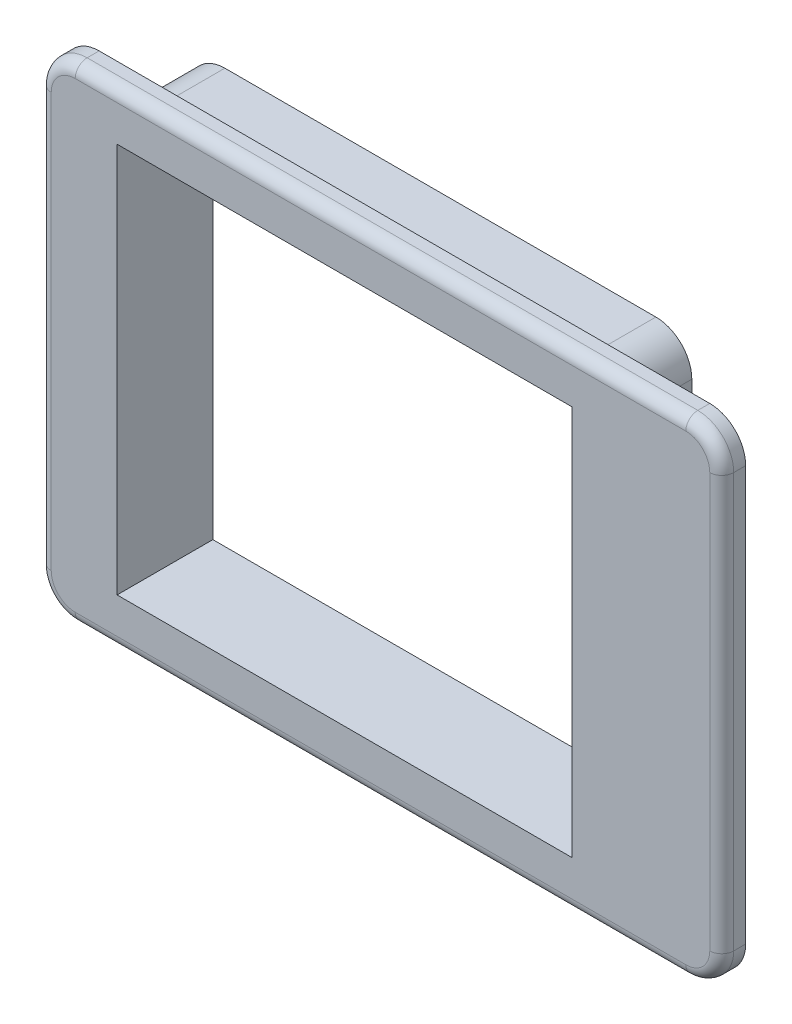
ISO-10303-21;
HEADER;
FILE_DESCRIPTION(('STEP AP214'),'2;1');
FILE_NAME('part.step','',(''),(''),'','','');
FILE_SCHEMA(('AUTOMOTIVE_DESIGN { 1 0 10303 214 1 1 1 1 }'));
ENDSEC;
DATA;
#1=APPLICATION_CONTEXT('core data for automotive mechanical design processes');
#2=APPLICATION_PROTOCOL_DEFINITION('international standard','automotive_design',2000,#1);
#3=PRODUCT_CONTEXT('',#1,'mechanical');
#4=PRODUCT('Part','Part','',(#3));
#5=PRODUCT_RELATED_PRODUCT_CATEGORY('part','',(#4));
#6=PRODUCT_DEFINITION_FORMATION('','',#4);
#7=PRODUCT_DEFINITION_CONTEXT('part definition',#1,'design');
#8=PRODUCT_DEFINITION('design','',#6,#7);
#9=PRODUCT_DEFINITION_SHAPE('','',#8);
#10=(LENGTH_UNIT() NAMED_UNIT(*) SI_UNIT(.MILLI.,.METRE.));
#11=(NAMED_UNIT(*) PLANE_ANGLE_UNIT() SI_UNIT($,.RADIAN.));
#12=(NAMED_UNIT(*) SI_UNIT($,.STERADIAN.) SOLID_ANGLE_UNIT());
#13=UNCERTAINTY_MEASURE_WITH_UNIT(LENGTH_MEASURE(1.E-05),#10,'distance_accuracy_value','');
#14=(GEOMETRIC_REPRESENTATION_CONTEXT(3) GLOBAL_UNCERTAINTY_ASSIGNED_CONTEXT((#13)) GLOBAL_UNIT_ASSIGNED_CONTEXT((#10,
#11,#12)) REPRESENTATION_CONTEXT('',''));
#15=CARTESIAN_POINT('',(0.,0.,0.));
#16=DIRECTION('',(0.,0.,1.));
#17=DIRECTION('',(1.,0.,0.));
#18=AXIS2_PLACEMENT_3D('',#15,#16,#17);
#19=CARTESIAN_POINT('',(1.00000000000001,1.,0.));
#20=DIRECTION('',(0.,0.,1.));
#21=DIRECTION('',(1.,0.,0.));
#22=AXIS2_PLACEMENT_3D('',#19,#20,#21);
#23=PLANE('',#22);
#24=CARTESIAN_POINT('',(1.00000000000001,1.,0.));
#25=DIRECTION('',(0.,0.,1.));
#26=DIRECTION('',(1.,0.,0.));
#27=AXIS2_PLACEMENT_3D('',#24,#25,#26);
#28=CIRCLE('',#27,3.);
#29=CARTESIAN_POINT('',(-2.,1.00000000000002,0.));
#30=VERTEX_POINT('',#29);
#31=CARTESIAN_POINT('',(1.00000000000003,-2.,0.));
#32=VERTEX_POINT('',#31);
#33=EDGE_CURVE('E202',#30,#32,#28,.T.);
#34=ORIENTED_EDGE('',*,*,#33,.F.);
#35=DIRECTION('',(0.,-1.,0.));
#36=VECTOR('',#35,1.);
#37=CARTESIAN_POINT('',(-2.,31.6,0.));
#38=LINE('',#37,#36);
#39=CARTESIAN_POINT('',(-2.,31.6,0.));
#40=VERTEX_POINT('',#39);
#41=EDGE_CURVE('E279',#40,#30,#38,.T.);
#42=ORIENTED_EDGE('',*,*,#41,.F.);
#43=CARTESIAN_POINT('',(1.,31.6,0.));
#44=DIRECTION('',(0.,0.,1.));
#45=DIRECTION('',(1.,0.,0.));
#46=AXIS2_PLACEMENT_3D('',#43,#44,#45);
#47=CIRCLE('',#46,3.);
#48=CARTESIAN_POINT('',(1.00000000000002,34.6,0.));
#49=VERTEX_POINT('',#48);
#50=EDGE_CURVE('E313',#49,#40,#47,.T.);
#51=ORIENTED_EDGE('',*,*,#50,.F.);
#52=DIRECTION('',(-1.,0.,0.));
#53=VECTOR('',#52,1.);
#54=CARTESIAN_POINT('',(1.00000000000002,34.6,0.));
#55=LINE('',#54,#53);
#56=CARTESIAN_POINT('',(37.,34.6,0.));
#57=VERTEX_POINT('',#56);
#58=EDGE_CURVE('E311',#57,#49,#55,.T.);
#59=ORIENTED_EDGE('',*,*,#58,.F.);
#60=CARTESIAN_POINT('',(37.,31.6,0.));
#61=DIRECTION('',(0.,0.,1.));
#62=DIRECTION('',(-1.,0.,0.));
#63=AXIS2_PLACEMENT_3D('',#60,#61,#62);
#64=CIRCLE('',#63,3.);
#65=CARTESIAN_POINT('',(40.,31.6,0.));
#66=VERTEX_POINT('',#65);
#67=EDGE_CURVE('E309',#66,#57,#64,.T.);
#68=ORIENTED_EDGE('',*,*,#67,.F.);
#69=DIRECTION('',(0.,1.,0.));
#70=VECTOR('',#69,1.);
#71=CARTESIAN_POINT('',(40.,31.6,0.));
#72=LINE('',#71,#70);
#73=CARTESIAN_POINT('',(40.,1.00000000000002,0.));
#74=VERTEX_POINT('',#73);
#75=EDGE_CURVE('E307',#74,#66,#72,.T.);
#76=ORIENTED_EDGE('',*,*,#75,.F.);
#77=CARTESIAN_POINT('',(37.,1.,0.));
#78=DIRECTION('',(0.,0.,1.));
#79=DIRECTION('',(1.,0.,0.));
#80=AXIS2_PLACEMENT_3D('',#77,#78,#79);
#81=CIRCLE('',#80,3.);
#82=CARTESIAN_POINT('',(37.,-2.,0.));
#83=VERTEX_POINT('',#82);
#84=EDGE_CURVE('E305',#83,#74,#81,.T.);
#85=ORIENTED_EDGE('',*,*,#84,.F.);
#86=DIRECTION('',(1.,0.,0.));
#87=VECTOR('',#86,1.);
#88=CARTESIAN_POINT('',(1.00000000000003,-2.,0.));
#89=LINE('',#88,#87);
#90=EDGE_CURVE('E303',#32,#83,#89,.T.);
#91=ORIENTED_EDGE('',*,*,#90,.F.);
#92=EDGE_LOOP('',(#34,#42,#51,#59,#68,#76,#85,#91));
#93=FACE_BOUND('',#92,.T.);
#94=DIRECTION('',(0.,-1.,0.));
#95=VECTOR('',#94,1.);
#96=CARTESIAN_POINT('',(0.,0.,0.));
#97=LINE('',#96,#95);
#98=CARTESIAN_POINT('',(0.,32.6,0.));
#99=VERTEX_POINT('',#98);
#100=CARTESIAN_POINT('',(0.,0.,0.));
#101=VERTEX_POINT('',#100);
#102=EDGE_CURVE('E262',#99,#101,#97,.T.);
#103=ORIENTED_EDGE('',*,*,#102,.T.);
#104=DIRECTION('',(1.,0.,0.));
#105=VECTOR('',#104,1.);
#106=CARTESIAN_POINT('',(0.,0.,0.));
#107=LINE('',#106,#105);
#108=CARTESIAN_POINT('',(38.,0.,0.));
#109=VERTEX_POINT('',#108);
#110=EDGE_CURVE('E199',#101,#109,#107,.T.);
#111=ORIENTED_EDGE('',*,*,#110,.T.);
#112=DIRECTION('',(0.,1.,0.));
#113=VECTOR('',#112,1.);
#114=CARTESIAN_POINT('',(38.,0.,0.));
#115=LINE('',#114,#113);
#116=CARTESIAN_POINT('',(38.,32.6,0.));
#117=VERTEX_POINT('',#116);
#118=EDGE_CURVE('E265',#109,#117,#115,.T.);
#119=ORIENTED_EDGE('',*,*,#118,.T.);
#120=DIRECTION('',(-1.,0.,0.));
#121=VECTOR('',#120,1.);
#122=CARTESIAN_POINT('',(0.,32.6,0.));
#123=LINE('',#122,#121);
#124=EDGE_CURVE('E268',#117,#99,#123,.T.);
#125=ORIENTED_EDGE('',*,*,#124,.T.);
#126=EDGE_LOOP('',(#103,#111,#119,#125));
#127=FACE_BOUND('',#126,.T.);
#128=ADVANCED_FACE('F31',(#93,#127),#23,.F.);
#129=CARTESIAN_POINT('',(1.00000000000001,1.,6.));
#130=DIRECTION('',(0.,0.,-1.));
#131=DIRECTION('',(-1.,0.,0.));
#132=AXIS2_PLACEMENT_3D('',#129,#130,#131);
#133=CYLINDRICAL_SURFACE('',#132,3.);
#134=ORIENTED_EDGE('',*,*,#33,.T.);
#135=DIRECTION('',(0.,0.,-1.));
#136=VECTOR('',#135,1.);
#137=CARTESIAN_POINT('',(1.00000000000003,-2.,6.));
#138=LINE('',#137,#136);
#139=CARTESIAN_POINT('',(1.00000000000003,-2.,6.));
#140=VERTEX_POINT('',#139);
#141=EDGE_CURVE('E336',#140,#32,#138,.T.);
#142=ORIENTED_EDGE('',*,*,#141,.F.);
#143=CARTESIAN_POINT('',(1.00000000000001,1.,6.));
#144=DIRECTION('',(0.,0.,1.));
#145=DIRECTION('',(1.,0.,0.));
#146=AXIS2_PLACEMENT_3D('',#143,#144,#145);
#147=CIRCLE('',#146,3.);
#148=CARTESIAN_POINT('',(-2.,1.00000000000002,6.));
#149=VERTEX_POINT('',#148);
#150=EDGE_CURVE('E275',#149,#140,#147,.T.);
#151=ORIENTED_EDGE('',*,*,#150,.F.);
#152=DIRECTION('',(0.,0.,-1.));
#153=VECTOR('',#152,1.);
#154=CARTESIAN_POINT('',(-2.,1.00000000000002,6.));
#155=LINE('',#154,#153);
#156=EDGE_CURVE('E300',#149,#30,#155,.T.);
#157=ORIENTED_EDGE('',*,*,#156,.T.);
#158=EDGE_LOOP('',(#134,#142,#151,#157));
#159=FACE_BOUND('',#158,.T.);
#160=ADVANCED_FACE('F458',(#159),#133,.T.);
#161=CARTESIAN_POINT('',(1.00000000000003,-2.,6.));
#162=DIRECTION('',(0.,1.,0.));
#163=DIRECTION('',(0.,0.,1.));
#164=AXIS2_PLACEMENT_3D('',#161,#162,#163);
#165=PLANE('',#164);
#166=ORIENTED_EDGE('',*,*,#90,.T.);
#167=DIRECTION('',(0.,0.,-1.));
#168=VECTOR('',#167,1.);
#169=CARTESIAN_POINT('',(37.,-2.,6.));
#170=LINE('',#169,#168);
#171=CARTESIAN_POINT('',(37.,-2.,6.));
#172=VERTEX_POINT('',#171);
#173=EDGE_CURVE('E333',#172,#83,#170,.T.);
#174=ORIENTED_EDGE('',*,*,#173,.F.);
#175=DIRECTION('',(1.,0.,0.));
#176=VECTOR('',#175,1.);
#177=CARTESIAN_POINT('',(1.00000000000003,-2.,6.));
#178=LINE('',#177,#176);
#179=EDGE_CURVE('E278',#140,#172,#178,.T.);
#180=ORIENTED_EDGE('',*,*,#179,.F.);
#181=ORIENTED_EDGE('',*,*,#141,.T.);
#182=EDGE_LOOP('',(#166,#174,#180,#181));
#183=FACE_BOUND('',#182,.T.);
#184=ADVANCED_FACE('F464',(#183),#165,.F.);
#185=CARTESIAN_POINT('',(37.,1.,6.));
#186=DIRECTION('',(0.,0.,-1.));
#187=DIRECTION('',(-1.,0.,0.));
#188=AXIS2_PLACEMENT_3D('',#185,#186,#187);
#189=CYLINDRICAL_SURFACE('',#188,3.);
#190=ORIENTED_EDGE('',*,*,#84,.T.);
#191=DIRECTION('',(0.,0.,-1.));
#192=VECTOR('',#191,1.);
#193=CARTESIAN_POINT('',(40.,1.00000000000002,6.));
#194=LINE('',#193,#192);
#195=CARTESIAN_POINT('',(40.,1.00000000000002,6.));
#196=VERTEX_POINT('',#195);
#197=EDGE_CURVE('E330',#196,#74,#194,.T.);
#198=ORIENTED_EDGE('',*,*,#197,.F.);
#199=CARTESIAN_POINT('',(37.,1.,6.));
#200=DIRECTION('',(0.,0.,1.));
#201=DIRECTION('',(1.,0.,0.));
#202=AXIS2_PLACEMENT_3D('',#199,#200,#201);
#203=CIRCLE('',#202,3.);
#204=EDGE_CURVE('E282',#172,#196,#203,.T.);
#205=ORIENTED_EDGE('',*,*,#204,.F.);
#206=ORIENTED_EDGE('',*,*,#173,.T.);
#207=EDGE_LOOP('',(#190,#198,#205,#206));
#208=FACE_BOUND('',#207,.T.);
#209=ADVANCED_FACE('F491',(#208),#189,.T.);
#210=CARTESIAN_POINT('',(40.,31.6,6.));
#211=DIRECTION('',(-1.,0.,0.));
#212=DIRECTION('',(0.,-1.,0.));
#213=AXIS2_PLACEMENT_3D('',#210,#211,#212);
#214=PLANE('',#213);
#215=ORIENTED_EDGE('',*,*,#75,.T.);
#216=DIRECTION('',(0.,0.,-1.));
#217=VECTOR('',#216,1.);
#218=CARTESIAN_POINT('',(40.,31.6,6.));
#219=LINE('',#218,#217);
#220=CARTESIAN_POINT('',(40.,31.6,6.));
#221=VERTEX_POINT('',#220);
#222=EDGE_CURVE('E327',#221,#66,#219,.T.);
#223=ORIENTED_EDGE('',*,*,#222,.F.);
#224=DIRECTION('',(0.,1.,0.));
#225=VECTOR('',#224,1.);
#226=CARTESIAN_POINT('',(40.,31.6,6.));
#227=LINE('',#226,#225);
#228=EDGE_CURVE('E285',#196,#221,#227,.T.);
#229=ORIENTED_EDGE('',*,*,#228,.F.);
#230=ORIENTED_EDGE('',*,*,#197,.T.);
#231=EDGE_LOOP('',(#215,#223,#229,#230));
#232=FACE_BOUND('',#231,.T.);
#233=ADVANCED_FACE('F487',(#232),#214,.F.);
#234=CARTESIAN_POINT('',(37.,31.6,6.));
#235=DIRECTION('',(0.,0.,-1.));
#236=DIRECTION('',(-1.,0.,0.));
#237=AXIS2_PLACEMENT_3D('',#234,#235,#236);
#238=CYLINDRICAL_SURFACE('',#237,3.);
#239=ORIENTED_EDGE('',*,*,#67,.T.);
#240=DIRECTION('',(0.,0.,-1.));
#241=VECTOR('',#240,1.);
#242=CARTESIAN_POINT('',(37.,34.6,6.));
#243=LINE('',#242,#241);
#244=CARTESIAN_POINT('',(37.,34.6,6.));
#245=VERTEX_POINT('',#244);
#246=EDGE_CURVE('E324',#245,#57,#243,.T.);
#247=ORIENTED_EDGE('',*,*,#246,.F.);
#248=CARTESIAN_POINT('',(37.,31.6,6.));
#249=DIRECTION('',(0.,0.,1.));
#250=DIRECTION('',(-1.,0.,0.));
#251=AXIS2_PLACEMENT_3D('',#248,#249,#250);
#252=CIRCLE('',#251,3.);
#253=EDGE_CURVE('E288',#221,#245,#252,.T.);
#254=ORIENTED_EDGE('',*,*,#253,.F.);
#255=ORIENTED_EDGE('',*,*,#222,.T.);
#256=EDGE_LOOP('',(#239,#247,#254,#255));
#257=FACE_BOUND('',#256,.T.);
#258=ADVANCED_FACE('F483',(#257),#238,.T.);
#259=CARTESIAN_POINT('',(1.00000000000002,34.6,6.));
#260=DIRECTION('',(0.,-1.,0.));
#261=DIRECTION('',(0.,0.,-1.));
#262=AXIS2_PLACEMENT_3D('',#259,#260,#261);
#263=PLANE('',#262);
#264=ORIENTED_EDGE('',*,*,#58,.T.);
#265=DIRECTION('',(0.,0.,-1.));
#266=VECTOR('',#265,1.);
#267=CARTESIAN_POINT('',(1.00000000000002,34.6,6.));
#268=LINE('',#267,#266);
#269=CARTESIAN_POINT('',(1.00000000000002,34.6,6.));
#270=VERTEX_POINT('',#269);
#271=EDGE_CURVE('E321',#270,#49,#268,.T.);
#272=ORIENTED_EDGE('',*,*,#271,.F.);
#273=DIRECTION('',(-1.,0.,0.));
#274=VECTOR('',#273,1.);
#275=CARTESIAN_POINT('',(1.00000000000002,34.6,6.));
#276=LINE('',#275,#274);
#277=EDGE_CURVE('E291',#245,#270,#276,.T.);
#278=ORIENTED_EDGE('',*,*,#277,.F.);
#279=ORIENTED_EDGE('',*,*,#246,.T.);
#280=EDGE_LOOP('',(#264,#272,#278,#279));
#281=FACE_BOUND('',#280,.T.);
#282=ADVANCED_FACE('F479',(#281),#263,.F.);
#283=CARTESIAN_POINT('',(1.,31.6,6.));
#284=DIRECTION('',(0.,0.,-1.));
#285=DIRECTION('',(-1.,0.,0.));
#286=AXIS2_PLACEMENT_3D('',#283,#284,#285);
#287=CYLINDRICAL_SURFACE('',#286,3.);
#288=ORIENTED_EDGE('',*,*,#50,.T.);
#289=DIRECTION('',(0.,0.,-1.));
#290=VECTOR('',#289,1.);
#291=CARTESIAN_POINT('',(-2.,31.6,6.));
#292=LINE('',#291,#290);
#293=CARTESIAN_POINT('',(-2.,31.6,6.));
#294=VERTEX_POINT('',#293);
#295=EDGE_CURVE('E318',#294,#40,#292,.T.);
#296=ORIENTED_EDGE('',*,*,#295,.F.);
#297=CARTESIAN_POINT('',(1.,31.6,6.));
#298=DIRECTION('',(0.,0.,1.));
#299=DIRECTION('',(1.,0.,0.));
#300=AXIS2_PLACEMENT_3D('',#297,#298,#299);
#301=CIRCLE('',#300,3.);
#302=EDGE_CURVE('E294',#270,#294,#301,.T.);
#303=ORIENTED_EDGE('',*,*,#302,.F.);
#304=ORIENTED_EDGE('',*,*,#271,.T.);
#305=EDGE_LOOP('',(#288,#296,#303,#304));
#306=FACE_BOUND('',#305,.T.);
#307=ADVANCED_FACE('F475',(#306),#287,.T.);
#308=CARTESIAN_POINT('',(-2.,31.6,6.));
#309=DIRECTION('',(1.,0.,0.));
#310=DIRECTION('',(0.,1.,0.));
#311=AXIS2_PLACEMENT_3D('',#308,#309,#310);
#312=PLANE('',#311);
#313=ORIENTED_EDGE('',*,*,#41,.T.);
#314=ORIENTED_EDGE('',*,*,#156,.F.);
#315=DIRECTION('',(0.,-1.,0.));
#316=VECTOR('',#315,1.);
#317=CARTESIAN_POINT('',(-2.,31.6,6.));
#318=LINE('',#317,#316);
#319=EDGE_CURVE('E297',#294,#149,#318,.T.);
#320=ORIENTED_EDGE('',*,*,#319,.F.);
#321=ORIENTED_EDGE('',*,*,#295,.T.);
#322=EDGE_LOOP('',(#313,#314,#320,#321));
#323=FACE_BOUND('',#322,.T.);
#324=ADVANCED_FACE('F472',(#323),#312,.F.);
#325=CARTESIAN_POINT('',(0.,0.,6.));
#326=DIRECTION('',(1.,0.,0.));
#327=DIRECTION('',(0.,0.,-1.));
#328=AXIS2_PLACEMENT_3D('',#325,#326,#327);
#329=PLANE('',#328);
#330=ORIENTED_EDGE('',*,*,#102,.F.);
#331=DIRECTION('',(0.,0.,-1.));
#332=VECTOR('',#331,1.);
#333=CARTESIAN_POINT('',(0.,32.6,6.));
#334=LINE('',#333,#332);
#335=CARTESIAN_POINT('',(0.,32.6,8.));
#336=VERTEX_POINT('',#335);
#337=EDGE_CURVE('E209',#336,#99,#334,.T.);
#338=ORIENTED_EDGE('',*,*,#337,.F.);
#339=DIRECTION('',(0.,-1.,0.));
#340=VECTOR('',#339,1.);
#341=CARTESIAN_POINT('',(0.,32.6,8.));
#342=LINE('',#341,#340);
#343=CARTESIAN_POINT('',(0.,0.,8.));
#344=VERTEX_POINT('',#343);
#345=EDGE_CURVE('E206',#336,#344,#342,.T.);
#346=ORIENTED_EDGE('',*,*,#345,.T.);
#347=DIRECTION('',(0.,0.,-1.));
#348=VECTOR('',#347,1.);
#349=CARTESIAN_POINT('',(0.,0.,6.));
#350=LINE('',#349,#348);
#351=EDGE_CURVE('E192',#344,#101,#350,.T.);
#352=ORIENTED_EDGE('',*,*,#351,.T.);
#353=EDGE_LOOP('',(#330,#338,#346,#352));
#354=FACE_BOUND('',#353,.T.);
#355=ADVANCED_FACE('F207',(#354),#329,.T.);
#356=CARTESIAN_POINT('',(0.,0.,6.));
#357=DIRECTION('',(0.,1.,0.));
#358=DIRECTION('',(0.,0.,1.));
#359=AXIS2_PLACEMENT_3D('',#356,#357,#358);
#360=PLANE('',#359);
#361=ORIENTED_EDGE('',*,*,#110,.F.);
#362=ORIENTED_EDGE('',*,*,#351,.F.);
#363=DIRECTION('',(1.,0.,0.));
#364=VECTOR('',#363,1.);
#365=CARTESIAN_POINT('',(0.,0.,8.));
#366=LINE('',#365,#364);
#367=CARTESIAN_POINT('',(38.,0.,8.));
#368=VERTEX_POINT('',#367);
#369=EDGE_CURVE('E196',#344,#368,#366,.T.);
#370=ORIENTED_EDGE('',*,*,#369,.T.);
#371=DIRECTION('',(0.,0.,-1.));
#372=VECTOR('',#371,1.);
#373=CARTESIAN_POINT('',(38.,0.,6.));
#374=LINE('',#373,#372);
#375=EDGE_CURVE('E203',#368,#109,#374,.T.);
#376=ORIENTED_EDGE('',*,*,#375,.T.);
#377=EDGE_LOOP('',(#361,#362,#370,#376));
#378=FACE_BOUND('',#377,.T.);
#379=ADVANCED_FACE('F194',(#378),#360,.T.);
#380=CARTESIAN_POINT('',(38.,0.,6.));
#381=DIRECTION('',(-1.,0.,0.));
#382=DIRECTION('',(0.,0.,1.));
#383=AXIS2_PLACEMENT_3D('',#380,#381,#382);
#384=PLANE('',#383);
#385=ORIENTED_EDGE('',*,*,#118,.F.);
#386=ORIENTED_EDGE('',*,*,#375,.F.);
#387=DIRECTION('',(0.,1.,0.));
#388=VECTOR('',#387,1.);
#389=CARTESIAN_POINT('',(38.,32.6,8.));
#390=LINE('',#389,#388);
#391=CARTESIAN_POINT('',(38.,32.6,8.));
#392=VERTEX_POINT('',#391);
#393=EDGE_CURVE('E216',#368,#392,#390,.T.);
#394=ORIENTED_EDGE('',*,*,#393,.T.);
#395=DIRECTION('',(0.,0.,-1.));
#396=VECTOR('',#395,1.);
#397=CARTESIAN_POINT('',(38.,32.6,6.));
#398=LINE('',#397,#396);
#399=EDGE_CURVE('E272',#392,#117,#398,.T.);
#400=ORIENTED_EDGE('',*,*,#399,.T.);
#401=EDGE_LOOP('',(#385,#386,#394,#400));
#402=FACE_BOUND('',#401,.T.);
#403=ADVANCED_FACE('F631',(#402),#384,.T.);
#404=CARTESIAN_POINT('',(0.,32.6,6.));
#405=DIRECTION('',(0.,-1.,0.));
#406=DIRECTION('',(0.,0.,-1.));
#407=AXIS2_PLACEMENT_3D('',#404,#405,#406);
#408=PLANE('',#407);
#409=ORIENTED_EDGE('',*,*,#124,.F.);
#410=ORIENTED_EDGE('',*,*,#399,.F.);
#411=DIRECTION('',(-1.,0.,0.));
#412=VECTOR('',#411,1.);
#413=CARTESIAN_POINT('',(0.,32.6,8.));
#414=LINE('',#413,#412);
#415=EDGE_CURVE('E218',#392,#336,#414,.T.);
#416=ORIENTED_EDGE('',*,*,#415,.T.);
#417=ORIENTED_EDGE('',*,*,#337,.T.);
#418=EDGE_LOOP('',(#409,#410,#416,#417));
#419=FACE_BOUND('',#418,.T.);
#420=ADVANCED_FACE('F622',(#419),#408,.T.);
#421=CARTESIAN_POINT('',(-3.49999999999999,-1.,6.));
#422=DIRECTION('',(0.,0.,1.));
#423=DIRECTION('',(1.,0.,0.));
#424=AXIS2_PLACEMENT_3D('',#421,#422,#423);
#425=PLANE('',#424);
#426=CARTESIAN_POINT('',(-3.49999999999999,-1.,6.));
#427=DIRECTION('',(0.,0.,1.));
#428=DIRECTION('',(1.,0.,0.));
#429=AXIS2_PLACEMENT_3D('',#426,#427,#428);
#430=CIRCLE('',#429,3.);
#431=CARTESIAN_POINT('',(-6.49999999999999,-1.,6.));
#432=VERTEX_POINT('',#431);
#433=CARTESIAN_POINT('',(-3.49999999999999,-4.,6.));
#434=VERTEX_POINT('',#433);
#435=EDGE_CURVE('E222',#432,#434,#430,.T.);
#436=ORIENTED_EDGE('',*,*,#435,.F.);
#437=DIRECTION('',(0.,-1.,0.));
#438=VECTOR('',#437,1.);
#439=CARTESIAN_POINT('',(-6.5,33.6,6.));
#440=LINE('',#439,#438);
#441=CARTESIAN_POINT('',(-6.5,33.6,6.));
#442=VERTEX_POINT('',#441);
#443=EDGE_CURVE('E243',#442,#432,#440,.T.);
#444=ORIENTED_EDGE('',*,*,#443,.F.);
#445=CARTESIAN_POINT('',(-3.5,33.6,6.));
#446=DIRECTION('',(0.,0.,1.));
#447=DIRECTION('',(1.,0.,0.));
#448=AXIS2_PLACEMENT_3D('',#445,#446,#447);
#449=CIRCLE('',#448,3.);
#450=CARTESIAN_POINT('',(-3.5,36.6,6.));
#451=VERTEX_POINT('',#450);
#452=EDGE_CURVE('E240',#451,#442,#449,.T.);
#453=ORIENTED_EDGE('',*,*,#452,.F.);
#454=DIRECTION('',(-1.,0.,0.));
#455=VECTOR('',#454,1.);
#456=CARTESIAN_POINT('',(-3.5,36.6,6.));
#457=LINE('',#456,#455);
#458=CARTESIAN_POINT('',(47.5,36.6,6.));
#459=VERTEX_POINT('',#458);
#460=EDGE_CURVE('E237',#459,#451,#457,.T.);
#461=ORIENTED_EDGE('',*,*,#460,.F.);
#462=CARTESIAN_POINT('',(47.5,33.6,6.));
#463=DIRECTION('',(0.,0.,1.));
#464=DIRECTION('',(-1.,0.,0.));
#465=AXIS2_PLACEMENT_3D('',#462,#463,#464);
#466=CIRCLE('',#465,3.);
#467=CARTESIAN_POINT('',(50.5,33.6,6.));
#468=VERTEX_POINT('',#467);
#469=EDGE_CURVE('E234',#468,#459,#466,.T.);
#470=ORIENTED_EDGE('',*,*,#469,.F.);
#471=DIRECTION('',(0.,1.,0.));
#472=VECTOR('',#471,1.);
#473=CARTESIAN_POINT('',(50.5,33.6,6.));
#474=LINE('',#473,#472);
#475=CARTESIAN_POINT('',(50.5,-1.,6.));
#476=VERTEX_POINT('',#475);
#477=EDGE_CURVE('E231',#476,#468,#474,.T.);
#478=ORIENTED_EDGE('',*,*,#477,.F.);
#479=CARTESIAN_POINT('',(47.5,-1.,6.));
#480=DIRECTION('',(0.,0.,1.));
#481=DIRECTION('',(1.,0.,0.));
#482=AXIS2_PLACEMENT_3D('',#479,#480,#481);
#483=CIRCLE('',#482,3.);
#484=CARTESIAN_POINT('',(47.5,-4.,6.));
#485=VERTEX_POINT('',#484);
#486=EDGE_CURVE('E228',#485,#476,#483,.T.);
#487=ORIENTED_EDGE('',*,*,#486,.F.);
#488=DIRECTION('',(1.,0.,0.));
#489=VECTOR('',#488,1.);
#490=CARTESIAN_POINT('',(-3.49999999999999,-4.,6.));
#491=LINE('',#490,#489);
#492=EDGE_CURVE('E225',#434,#485,#491,.T.);
#493=ORIENTED_EDGE('',*,*,#492,.F.);
#494=EDGE_LOOP('',(#436,#444,#453,#461,#470,#478,#487,#493));
#495=FACE_BOUND('',#494,.T.);
#496=ORIENTED_EDGE('',*,*,#319,.T.);
#497=ORIENTED_EDGE('',*,*,#150,.T.);
#498=ORIENTED_EDGE('',*,*,#179,.T.);
#499=ORIENTED_EDGE('',*,*,#204,.T.);
#500=ORIENTED_EDGE('',*,*,#228,.T.);
#501=ORIENTED_EDGE('',*,*,#253,.T.);
#502=ORIENTED_EDGE('',*,*,#277,.T.);
#503=ORIENTED_EDGE('',*,*,#302,.T.);
#504=EDGE_LOOP('',(#496,#497,#498,#499,#500,#501,#502,#503));
#505=FACE_BOUND('',#504,.T.);
#506=ADVANCED_FACE('F413',(#495,#505),#425,.F.);
#507=CARTESIAN_POINT('',(-3.49999999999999,-1.,8.));
#508=DIRECTION('',(0.,0.,1.));
#509=DIRECTION('',(1.,0.,0.));
#510=AXIS2_PLACEMENT_3D('',#507,#508,#509);
#511=PLANE('',#510);
#512=DIRECTION('',(-1.,0.,0.));
#513=VECTOR('',#512,1.);
#514=CARTESIAN_POINT('',(-3.5,35.6,8.));
#515=LINE('',#514,#513);
#516=CARTESIAN_POINT('',(47.5,35.6,8.));
#517=VERTEX_POINT('',#516);
#518=CARTESIAN_POINT('',(-3.5,35.6,8.));
#519=VERTEX_POINT('',#518);
#520=EDGE_CURVE('E339',#517,#519,#515,.T.);
#521=ORIENTED_EDGE('',*,*,#520,.T.);
#522=CARTESIAN_POINT('',(-3.5,33.6,8.));
#523=DIRECTION('',(0.,0.,1.));
#524=DIRECTION('',(1.,0.,0.));
#525=AXIS2_PLACEMENT_3D('',#522,#523,#524);
#526=CIRCLE('',#525,2.);
#527=CARTESIAN_POINT('',(-5.5,33.6,8.));
#528=VERTEX_POINT('',#527);
#529=EDGE_CURVE('E353',#519,#528,#526,.T.);
#530=ORIENTED_EDGE('',*,*,#529,.T.);
#531=DIRECTION('',(0.,-1.,0.));
#532=VECTOR('',#531,1.);
#533=CARTESIAN_POINT('',(-5.49999999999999,-1.,8.));
#534=LINE('',#533,#532);
#535=CARTESIAN_POINT('',(-5.49999999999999,-1.,8.));
#536=VERTEX_POINT('',#535);
#537=EDGE_CURVE('E351',#528,#536,#534,.T.);
#538=ORIENTED_EDGE('',*,*,#537,.T.);
#539=CARTESIAN_POINT('',(-3.49999999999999,-1.,8.));
#540=DIRECTION('',(0.,0.,1.));
#541=DIRECTION('',(1.,0.,0.));
#542=AXIS2_PLACEMENT_3D('',#539,#540,#541);
#543=CIRCLE('',#542,2.);
#544=CARTESIAN_POINT('',(-3.49999999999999,-3.,8.));
#545=VERTEX_POINT('',#544);
#546=EDGE_CURVE('E349',#536,#545,#543,.T.);
#547=ORIENTED_EDGE('',*,*,#546,.T.);
#548=DIRECTION('',(1.,0.,0.));
#549=VECTOR('',#548,1.);
#550=CARTESIAN_POINT('',(47.5,-3.,8.));
#551=LINE('',#550,#549);
#552=CARTESIAN_POINT('',(47.5,-3.,8.));
#553=VERTEX_POINT('',#552);
#554=EDGE_CURVE('E347',#545,#553,#551,.T.);
#555=ORIENTED_EDGE('',*,*,#554,.T.);
#556=CARTESIAN_POINT('',(47.5,-1.,8.));
#557=DIRECTION('',(0.,0.,1.));
#558=DIRECTION('',(1.,0.,0.));
#559=AXIS2_PLACEMENT_3D('',#556,#557,#558);
#560=CIRCLE('',#559,2.);
#561=CARTESIAN_POINT('',(49.5,-1.,8.));
#562=VERTEX_POINT('',#561);
#563=EDGE_CURVE('E345',#553,#562,#560,.T.);
#564=ORIENTED_EDGE('',*,*,#563,.T.);
#565=DIRECTION('',(0.,1.,0.));
#566=VECTOR('',#565,1.);
#567=CARTESIAN_POINT('',(49.5,33.6,8.));
#568=LINE('',#567,#566);
#569=CARTESIAN_POINT('',(49.5,33.6,8.));
#570=VERTEX_POINT('',#569);
#571=EDGE_CURVE('E343',#562,#570,#568,.T.);
#572=ORIENTED_EDGE('',*,*,#571,.T.);
#573=CARTESIAN_POINT('',(47.5,33.6,8.));
#574=DIRECTION('',(0.,0.,1.));
#575=DIRECTION('',(1.,0.,0.));
#576=AXIS2_PLACEMENT_3D('',#573,#574,#575);
#577=CIRCLE('',#576,2.);
#578=EDGE_CURVE('E341',#570,#517,#577,.T.);
#579=ORIENTED_EDGE('',*,*,#578,.T.);
#580=EDGE_LOOP('',(#521,#530,#538,#547,#555,#564,#572,#579));
#581=FACE_BOUND('',#580,.T.);
#582=ORIENTED_EDGE('',*,*,#369,.F.);
#583=ORIENTED_EDGE('',*,*,#345,.F.);
#584=ORIENTED_EDGE('',*,*,#415,.F.);
#585=ORIENTED_EDGE('',*,*,#393,.F.);
#586=EDGE_LOOP('',(#582,#583,#584,#585));
#587=FACE_BOUND('',#586,.T.);
#588=ADVANCED_FACE('F214',(#581,#587),#511,.T.);
#589=CARTESIAN_POINT('',(-3.49999999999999,-1.,8.));
#590=DIRECTION('',(0.,0.,-1.));
#591=DIRECTION('',(-1.,0.,0.));
#592=AXIS2_PLACEMENT_3D('',#589,#590,#591);
#593=CYLINDRICAL_SURFACE('',#592,3.);
#594=DIRECTION('',(0.,0.,-1.));
#595=VECTOR('',#594,1.);
#596=CARTESIAN_POINT('',(-3.49999999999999,-4.,8.));
#597=LINE('',#596,#595);
#598=CARTESIAN_POINT('',(-3.49999999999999,-4.,7.));
#599=VERTEX_POINT('',#598);
#600=EDGE_CURVE('E260',#599,#434,#597,.T.);
#601=ORIENTED_EDGE('',*,*,#600,.F.);
#602=CARTESIAN_POINT('',(-3.49999999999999,-1.,7.));
#603=DIRECTION('',(0.,0.,1.));
#604=DIRECTION('',(1.,0.,0.));
#605=AXIS2_PLACEMENT_3D('',#602,#603,#604);
#606=CIRCLE('',#605,3.);
#607=CARTESIAN_POINT('',(-6.49999999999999,-1.,7.));
#608=VERTEX_POINT('',#607);
#609=EDGE_CURVE('E361',#599,#608,#606,.F.);
#610=ORIENTED_EDGE('',*,*,#609,.T.);
#611=DIRECTION('',(0.,0.,-1.));
#612=VECTOR('',#611,1.);
#613=CARTESIAN_POINT('',(-6.49999999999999,-1.,8.));
#614=LINE('',#613,#612);
#615=EDGE_CURVE('E246',#608,#432,#614,.T.);
#616=ORIENTED_EDGE('',*,*,#615,.T.);
#617=ORIENTED_EDGE('',*,*,#435,.T.);
#618=EDGE_LOOP('',(#601,#610,#616,#617));
#619=FACE_BOUND('',#618,.T.);
#620=ADVANCED_FACE('F599',(#619),#593,.T.);
#621=CARTESIAN_POINT('',(-3.49999999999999,-4.,8.));
#622=DIRECTION('',(0.,1.,0.));
#623=DIRECTION('',(-1.,0.,0.));
#624=AXIS2_PLACEMENT_3D('',#621,#622,#623);
#625=PLANE('',#624);
#626=DIRECTION('',(0.,0.,-1.));
#627=VECTOR('',#626,1.);
#628=CARTESIAN_POINT('',(47.5,-4.,8.));
#629=LINE('',#628,#627);
#630=CARTESIAN_POINT('',(47.5,-4.,7.));
#631=VERTEX_POINT('',#630);
#632=EDGE_CURVE('E258',#631,#485,#629,.T.);
#633=ORIENTED_EDGE('',*,*,#632,.F.);
#634=DIRECTION('',(1.,0.,0.));
#635=VECTOR('',#634,1.);
#636=CARTESIAN_POINT('',(-3.49999999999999,-4.,7.));
#637=LINE('',#636,#635);
#638=EDGE_CURVE('E363',#631,#599,#637,.F.);
#639=ORIENTED_EDGE('',*,*,#638,.T.);
#640=ORIENTED_EDGE('',*,*,#600,.T.);
#641=ORIENTED_EDGE('',*,*,#492,.T.);
#642=EDGE_LOOP('',(#633,#639,#640,#641));
#643=FACE_BOUND('',#642,.T.);
#644=ADVANCED_FACE('F406',(#643),#625,.F.);
#645=CARTESIAN_POINT('',(47.5,-1.,8.));
#646=DIRECTION('',(0.,0.,-1.));
#647=DIRECTION('',(-1.,0.,0.));
#648=AXIS2_PLACEMENT_3D('',#645,#646,#647);
#649=CYLINDRICAL_SURFACE('',#648,3.);
#650=DIRECTION('',(0.,0.,-1.));
#651=VECTOR('',#650,1.);
#652=CARTESIAN_POINT('',(50.5,-1.,8.));
#653=LINE('',#652,#651);
#654=CARTESIAN_POINT('',(50.5,-1.,7.));
#655=VERTEX_POINT('',#654);
#656=EDGE_CURVE('E256',#655,#476,#653,.T.);
#657=ORIENTED_EDGE('',*,*,#656,.F.);
#658=CARTESIAN_POINT('',(47.5,-1.,7.));
#659=DIRECTION('',(0.,0.,1.));
#660=DIRECTION('',(1.,0.,0.));
#661=AXIS2_PLACEMENT_3D('',#658,#659,#660);
#662=CIRCLE('',#661,3.);
#663=EDGE_CURVE('E365',#655,#631,#662,.F.);
#664=ORIENTED_EDGE('',*,*,#663,.T.);
#665=ORIENTED_EDGE('',*,*,#632,.T.);
#666=ORIENTED_EDGE('',*,*,#486,.T.);
#667=EDGE_LOOP('',(#657,#664,#665,#666));
#668=FACE_BOUND('',#667,.T.);
#669=ADVANCED_FACE('F404',(#668),#649,.T.);
#670=CARTESIAN_POINT('',(50.5,33.6,8.));
#671=DIRECTION('',(-1.,0.,0.));
#672=DIRECTION('',(0.,-1.,0.));
#673=AXIS2_PLACEMENT_3D('',#670,#671,#672);
#674=PLANE('',#673);
#675=DIRECTION('',(0.,0.,-1.));
#676=VECTOR('',#675,1.);
#677=CARTESIAN_POINT('',(50.5,33.6,8.));
#678=LINE('',#677,#676);
#679=CARTESIAN_POINT('',(50.5,33.6,7.));
#680=VERTEX_POINT('',#679);
#681=EDGE_CURVE('E254',#680,#468,#678,.T.);
#682=ORIENTED_EDGE('',*,*,#681,.F.);
#683=DIRECTION('',(0.,1.,0.));
#684=VECTOR('',#683,1.);
#685=CARTESIAN_POINT('',(50.5,-1.,7.));
#686=LINE('',#685,#684);
#687=EDGE_CURVE('E367',#680,#655,#686,.F.);
#688=ORIENTED_EDGE('',*,*,#687,.T.);
#689=ORIENTED_EDGE('',*,*,#656,.T.);
#690=ORIENTED_EDGE('',*,*,#477,.T.);
#691=EDGE_LOOP('',(#682,#688,#689,#690));
#692=FACE_BOUND('',#691,.T.);
#693=ADVANCED_FACE('F418',(#692),#674,.F.);
#694=CARTESIAN_POINT('',(47.5,33.6,8.));
#695=DIRECTION('',(0.,0.,-1.));
#696=DIRECTION('',(-1.,0.,0.));
#697=AXIS2_PLACEMENT_3D('',#694,#695,#696);
#698=CYLINDRICAL_SURFACE('',#697,3.);
#699=DIRECTION('',(0.,0.,-1.));
#700=VECTOR('',#699,1.);
#701=CARTESIAN_POINT('',(47.5,36.6,8.));
#702=LINE('',#701,#700);
#703=CARTESIAN_POINT('',(47.5,36.6,7.));
#704=VERTEX_POINT('',#703);
#705=EDGE_CURVE('E252',#704,#459,#702,.T.);
#706=ORIENTED_EDGE('',*,*,#705,.F.);
#707=CARTESIAN_POINT('',(47.5,33.6,7.));
#708=DIRECTION('',(0.,0.,1.));
#709=DIRECTION('',(1.,0.,0.));
#710=AXIS2_PLACEMENT_3D('',#707,#708,#709);
#711=CIRCLE('',#710,3.);
#712=EDGE_CURVE('E40',#704,#680,#711,.F.);
#713=ORIENTED_EDGE('',*,*,#712,.T.);
#714=ORIENTED_EDGE('',*,*,#681,.T.);
#715=ORIENTED_EDGE('',*,*,#469,.T.);
#716=EDGE_LOOP('',(#706,#713,#714,#715));
#717=FACE_BOUND('',#716,.T.);
#718=ADVANCED_FACE('F419',(#717),#698,.T.);
#719=CARTESIAN_POINT('',(-3.5,36.6,8.));
#720=DIRECTION('',(0.,-1.,0.));
#721=DIRECTION('',(0.,0.,-1.));
#722=AXIS2_PLACEMENT_3D('',#719,#720,#721);
#723=PLANE('',#722);
#724=DIRECTION('',(0.,0.,-1.));
#725=VECTOR('',#724,1.);
#726=CARTESIAN_POINT('',(-3.5,36.6,8.));
#727=LINE('',#726,#725);
#728=CARTESIAN_POINT('',(-3.5,36.6,7.));
#729=VERTEX_POINT('',#728);
#730=EDGE_CURVE('E250',#729,#451,#727,.T.);
#731=ORIENTED_EDGE('',*,*,#730,.F.);
#732=DIRECTION('',(-1.,0.,0.));
#733=VECTOR('',#732,1.);
#734=CARTESIAN_POINT('',(47.5,36.6,7.));
#735=LINE('',#734,#733);
#736=EDGE_CURVE('E11',#729,#704,#735,.F.);
#737=ORIENTED_EDGE('',*,*,#736,.T.);
#738=ORIENTED_EDGE('',*,*,#705,.T.);
#739=ORIENTED_EDGE('',*,*,#460,.T.);
#740=EDGE_LOOP('',(#731,#737,#738,#739));
#741=FACE_BOUND('',#740,.T.);
#742=ADVANCED_FACE('F422',(#741),#723,.F.);
#743=CARTESIAN_POINT('',(-3.5,33.6,8.));
#744=DIRECTION('',(0.,0.,-1.));
#745=DIRECTION('',(-1.,0.,0.));
#746=AXIS2_PLACEMENT_3D('',#743,#744,#745);
#747=CYLINDRICAL_SURFACE('',#746,3.);
#748=DIRECTION('',(0.,0.,-1.));
#749=VECTOR('',#748,1.);
#750=CARTESIAN_POINT('',(-6.5,33.6,8.));
#751=LINE('',#750,#749);
#752=CARTESIAN_POINT('',(-6.5,33.6,7.));
#753=VERTEX_POINT('',#752);
#754=EDGE_CURVE('E248',#753,#442,#751,.T.);
#755=ORIENTED_EDGE('',*,*,#754,.F.);
#756=CARTESIAN_POINT('',(-3.5,33.6,7.));
#757=DIRECTION('',(0.,0.,1.));
#758=DIRECTION('',(1.,0.,0.));
#759=AXIS2_PLACEMENT_3D('',#756,#757,#758);
#760=CIRCLE('',#759,3.);
#761=EDGE_CURVE('E356',#753,#729,#760,.F.);
#762=ORIENTED_EDGE('',*,*,#761,.T.);
#763=ORIENTED_EDGE('',*,*,#730,.T.);
#764=ORIENTED_EDGE('',*,*,#452,.T.);
#765=EDGE_LOOP('',(#755,#762,#763,#764));
#766=FACE_BOUND('',#765,.T.);
#767=ADVANCED_FACE('F425',(#766),#747,.T.);
#768=CARTESIAN_POINT('',(-6.5,33.6,8.));
#769=DIRECTION('',(1.,0.,0.));
#770=DIRECTION('',(0.,1.,0.));
#771=AXIS2_PLACEMENT_3D('',#768,#769,#770);
#772=PLANE('',#771);
#773=ORIENTED_EDGE('',*,*,#615,.F.);
#774=DIRECTION('',(0.,-1.,0.));
#775=VECTOR('',#774,1.);
#776=CARTESIAN_POINT('',(-6.5,33.6,7.));
#777=LINE('',#776,#775);
#778=EDGE_CURVE('E359',#608,#753,#777,.F.);
#779=ORIENTED_EDGE('',*,*,#778,.T.);
#780=ORIENTED_EDGE('',*,*,#754,.T.);
#781=ORIENTED_EDGE('',*,*,#443,.T.);
#782=EDGE_LOOP('',(#773,#779,#780,#781));
#783=FACE_BOUND('',#782,.T.);
#784=ADVANCED_FACE('F549',(#783),#772,.F.);
#785=CARTESIAN_POINT('',(47.5,-1.,7.));
#786=DIRECTION('',(0.,0.,1.));
#787=DIRECTION('',(1.,0.,0.));
#788=AXIS2_PLACEMENT_3D('',#785,#786,#787);
#789=TOROIDAL_SURFACE('',#788,2.,1.);
#790=CARTESIAN_POINT('',(47.5,-3.,7.));
#791=DIRECTION('',(-1.,0.,0.));
#792=DIRECTION('',(0.,0.,1.));
#793=AXIS2_PLACEMENT_3D('',#790,#791,#792);
#794=CIRCLE('',#793,1.);
#795=EDGE_CURVE('E385',#631,#553,#794,.T.);
#796=ORIENTED_EDGE('',*,*,#795,.F.);
#797=ORIENTED_EDGE('',*,*,#663,.F.);
#798=CARTESIAN_POINT('',(49.5,-1.,7.));
#799=DIRECTION('',(0.,1.,0.));
#800=DIRECTION('',(-1.,0.,0.));
#801=AXIS2_PLACEMENT_3D('',#798,#799,#800);
#802=CIRCLE('',#801,1.);
#803=EDGE_CURVE('E35',#562,#655,#802,.T.);
#804=ORIENTED_EDGE('',*,*,#803,.F.);
#805=ORIENTED_EDGE('',*,*,#563,.F.);
#806=EDGE_LOOP('',(#796,#797,#804,#805));
#807=FACE_BOUND('',#806,.T.);
#808=ADVANCED_FACE('F33',(#807),#789,.T.);
#809=CARTESIAN_POINT('',(49.5,-0.999999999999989,7.));
#810=DIRECTION('',(0.,-1.,0.));
#811=DIRECTION('',(1.,0.,0.));
#812=AXIS2_PLACEMENT_3D('',#809,#810,#811);
#813=CYLINDRICAL_SURFACE('',#812,1.);
#814=ORIENTED_EDGE('',*,*,#803,.T.);
#815=ORIENTED_EDGE('',*,*,#687,.F.);
#816=CARTESIAN_POINT('',(49.5,33.6,7.));
#817=DIRECTION('',(0.,1.,0.));
#818=DIRECTION('',(0.,0.,1.));
#819=AXIS2_PLACEMENT_3D('',#816,#817,#818);
#820=CIRCLE('',#819,1.);
#821=EDGE_CURVE('E383',#570,#680,#820,.T.);
#822=ORIENTED_EDGE('',*,*,#821,.F.);
#823=ORIENTED_EDGE('',*,*,#571,.F.);
#824=EDGE_LOOP('',(#814,#815,#822,#823));
#825=FACE_BOUND('',#824,.T.);
#826=ADVANCED_FACE('F396',(#825),#813,.T.);
#827=CARTESIAN_POINT('',(-3.49999999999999,-3.,7.));
#828=DIRECTION('',(-1.,0.,0.));
#829=DIRECTION('',(0.,-1.,0.));
#830=AXIS2_PLACEMENT_3D('',#827,#828,#829);
#831=CYLINDRICAL_SURFACE('',#830,1.);
#832=ORIENTED_EDGE('',*,*,#795,.T.);
#833=ORIENTED_EDGE('',*,*,#554,.F.);
#834=CARTESIAN_POINT('',(-3.49999999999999,-3.,7.));
#835=DIRECTION('',(-1.,0.,0.));
#836=DIRECTION('',(0.,0.,1.));
#837=AXIS2_PLACEMENT_3D('',#834,#835,#836);
#838=CIRCLE('',#837,1.);
#839=EDGE_CURVE('E380',#599,#545,#838,.T.);
#840=ORIENTED_EDGE('',*,*,#839,.F.);
#841=ORIENTED_EDGE('',*,*,#638,.F.);
#842=EDGE_LOOP('',(#832,#833,#840,#841));
#843=FACE_BOUND('',#842,.T.);
#844=ADVANCED_FACE('F448',(#843),#831,.T.);
#845=CARTESIAN_POINT('',(47.5,33.6,7.));
#846=DIRECTION('',(0.,0.,1.));
#847=DIRECTION('',(1.,0.,0.));
#848=AXIS2_PLACEMENT_3D('',#845,#846,#847);
#849=TOROIDAL_SURFACE('',#848,2.,1.);
#850=ORIENTED_EDGE('',*,*,#821,.T.);
#851=ORIENTED_EDGE('',*,*,#712,.F.);
#852=CARTESIAN_POINT('',(47.5,35.6,7.));
#853=DIRECTION('',(-1.,0.,0.));
#854=DIRECTION('',(0.,0.,1.));
#855=AXIS2_PLACEMENT_3D('',#852,#853,#854);
#856=CIRCLE('',#855,1.);
#857=EDGE_CURVE('E377',#517,#704,#856,.T.);
#858=ORIENTED_EDGE('',*,*,#857,.F.);
#859=ORIENTED_EDGE('',*,*,#578,.F.);
#860=EDGE_LOOP('',(#850,#851,#858,#859));
#861=FACE_BOUND('',#860,.T.);
#862=ADVANCED_FACE('F445',(#861),#849,.T.);
#863=CARTESIAN_POINT('',(-3.49999999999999,-1.,7.));
#864=DIRECTION('',(0.,0.,1.));
#865=DIRECTION('',(1.,0.,0.));
#866=AXIS2_PLACEMENT_3D('',#863,#864,#865);
#867=TOROIDAL_SURFACE('',#866,2.,1.);
#868=ORIENTED_EDGE('',*,*,#839,.T.);
#869=ORIENTED_EDGE('',*,*,#546,.F.);
#870=CARTESIAN_POINT('',(-5.49999999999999,-1.,7.));
#871=DIRECTION('',(0.,1.,0.));
#872=DIRECTION('',(-1.,0.,0.));
#873=AXIS2_PLACEMENT_3D('',#870,#871,#872);
#874=CIRCLE('',#873,1.);
#875=EDGE_CURVE('E374',#608,#536,#874,.T.);
#876=ORIENTED_EDGE('',*,*,#875,.F.);
#877=ORIENTED_EDGE('',*,*,#609,.F.);
#878=EDGE_LOOP('',(#868,#869,#876,#877));
#879=FACE_BOUND('',#878,.T.);
#880=ADVANCED_FACE('F447',(#879),#867,.T.);
#881=CARTESIAN_POINT('',(-3.49999999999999,35.6,7.));
#882=DIRECTION('',(1.,0.,0.));
#883=DIRECTION('',(0.,0.,-1.));
#884=AXIS2_PLACEMENT_3D('',#881,#882,#883);
#885=CYLINDRICAL_SURFACE('',#884,1.);
#886=ORIENTED_EDGE('',*,*,#857,.T.);
#887=ORIENTED_EDGE('',*,*,#736,.F.);
#888=CARTESIAN_POINT('',(-3.5,35.6,7.));
#889=DIRECTION('',(-1.,0.,0.));
#890=DIRECTION('',(0.,0.,1.));
#891=AXIS2_PLACEMENT_3D('',#888,#889,#890);
#892=CIRCLE('',#891,1.);
#893=EDGE_CURVE('E372',#519,#729,#892,.T.);
#894=ORIENTED_EDGE('',*,*,#893,.F.);
#895=ORIENTED_EDGE('',*,*,#520,.F.);
#896=EDGE_LOOP('',(#886,#887,#894,#895));
#897=FACE_BOUND('',#896,.T.);
#898=ADVANCED_FACE('F443',(#897),#885,.T.);
#899=CARTESIAN_POINT('',(-5.49999999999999,-1.,7.));
#900=DIRECTION('',(0.,1.,0.));
#901=DIRECTION('',(-1.,0.,0.));
#902=AXIS2_PLACEMENT_3D('',#899,#900,#901);
#903=CYLINDRICAL_SURFACE('',#902,1.);
#904=ORIENTED_EDGE('',*,*,#875,.T.);
#905=ORIENTED_EDGE('',*,*,#537,.F.);
#906=CARTESIAN_POINT('',(-5.5,33.6,7.));
#907=DIRECTION('',(0.,1.,0.));
#908=DIRECTION('',(0.,0.,1.));
#909=AXIS2_PLACEMENT_3D('',#906,#907,#908);
#910=CIRCLE('',#909,1.);
#911=EDGE_CURVE('E370',#753,#528,#910,.T.);
#912=ORIENTED_EDGE('',*,*,#911,.F.);
#913=ORIENTED_EDGE('',*,*,#778,.F.);
#914=EDGE_LOOP('',(#904,#905,#912,#913));
#915=FACE_BOUND('',#914,.T.);
#916=ADVANCED_FACE('F435',(#915),#903,.T.);
#917=CARTESIAN_POINT('',(-3.5,33.6,7.));
#918=DIRECTION('',(0.,0.,1.));
#919=DIRECTION('',(1.,0.,0.));
#920=AXIS2_PLACEMENT_3D('',#917,#918,#919);
#921=TOROIDAL_SURFACE('',#920,2.,1.);
#922=ORIENTED_EDGE('',*,*,#893,.T.);
#923=ORIENTED_EDGE('',*,*,#761,.F.);
#924=ORIENTED_EDGE('',*,*,#911,.T.);
#925=ORIENTED_EDGE('',*,*,#529,.F.);
#926=EDGE_LOOP('',(#922,#923,#924,#925));
#927=FACE_BOUND('',#926,.T.);
#928=ADVANCED_FACE('F429',(#927),#921,.T.);
#929=CLOSED_SHELL('',(#128,#160,#184,#209,#233,#258,#282,#307,#324,#355,#379,#403,#420,#506,
#588,#620,#644,#669,#693,#718,#742,#767,#784,#808,#826,#844,#862,#880,#898,#916,#928));
#930=MANIFOLD_SOLID_BREP('B2',#929);
#931=ADVANCED_BREP_SHAPE_REPRESENTATION('',(#18,#930),#14);
#932=SHAPE_DEFINITION_REPRESENTATION(#9,#931);
ENDSEC;
END-ISO-10303-21;
